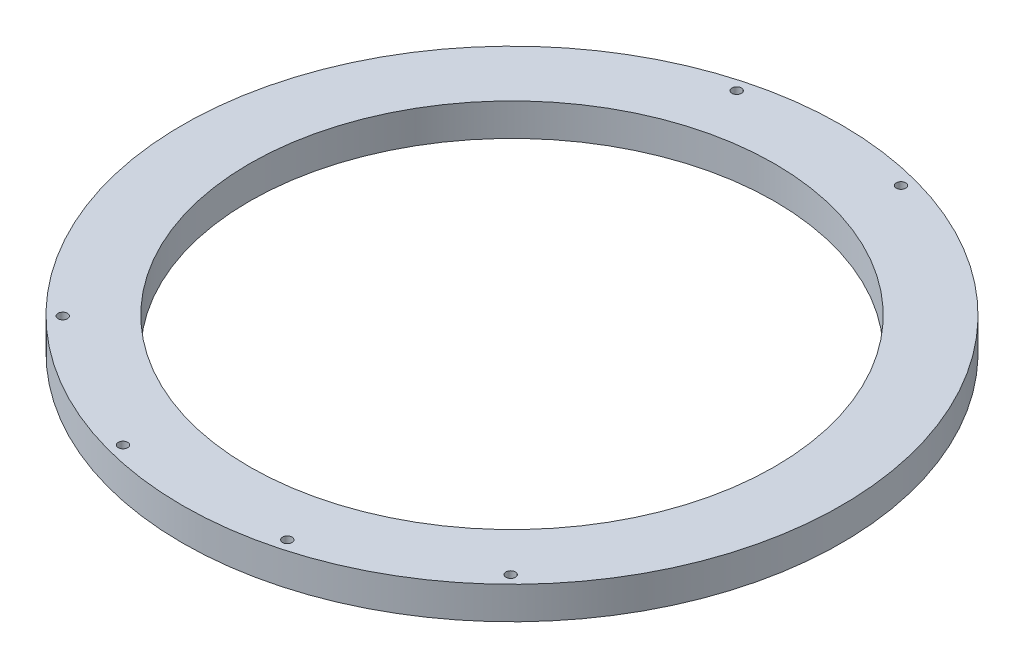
ISO-10303-21;
HEADER;
FILE_DESCRIPTION(('STEP AP214'),'2;1');
FILE_NAME('part.step','',(''),(''),'','','');
FILE_SCHEMA(('AUTOMOTIVE_DESIGN { 1 0 10303 214 1 1 1 1 }'));
ENDSEC;
DATA;
#1=APPLICATION_CONTEXT('core data for automotive mechanical design processes');
#2=APPLICATION_PROTOCOL_DEFINITION('international standard','automotive_design',2000,#1);
#3=PRODUCT_CONTEXT('',#1,'mechanical');
#4=PRODUCT('Part','Part','',(#3));
#5=PRODUCT_RELATED_PRODUCT_CATEGORY('part','',(#4));
#6=PRODUCT_DEFINITION_FORMATION('','',#4);
#7=PRODUCT_DEFINITION_CONTEXT('part definition',#1,'design');
#8=PRODUCT_DEFINITION('design','',#6,#7);
#9=PRODUCT_DEFINITION_SHAPE('','',#8);
#10=(LENGTH_UNIT() NAMED_UNIT(*) SI_UNIT(.MILLI.,.METRE.));
#11=(NAMED_UNIT(*) PLANE_ANGLE_UNIT() SI_UNIT($,.RADIAN.));
#12=(NAMED_UNIT(*) SI_UNIT($,.STERADIAN.) SOLID_ANGLE_UNIT());
#13=UNCERTAINTY_MEASURE_WITH_UNIT(LENGTH_MEASURE(1.E-05),#10,'distance_accuracy_value','');
#14=(GEOMETRIC_REPRESENTATION_CONTEXT(3) GLOBAL_UNCERTAINTY_ASSIGNED_CONTEXT((#13)) GLOBAL_UNIT_ASSIGNED_CONTEXT((#10,
#11,#12)) REPRESENTATION_CONTEXT('',''));
#15=CARTESIAN_POINT('',(0.,0.,0.));
#16=DIRECTION('',(0.,0.,1.));
#17=DIRECTION('',(1.,0.,0.));
#18=AXIS2_PLACEMENT_3D('',#15,#16,#17);
#19=CARTESIAN_POINT('',(0.,3.2258,0.));
#20=DIRECTION('',(0.,1.,0.));
#21=DIRECTION('',(0.,0.,1.));
#22=AXIS2_PLACEMENT_3D('',#19,#20,#21);
#23=PLANE('',#22);
#24=CARTESIAN_POINT('',(22.23135,3.2258,22.3644034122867));
#25=DIRECTION('',(0.,1.,0.));
#26=DIRECTION('',(0.,0.,1.));
#27=AXIS2_PLACEMENT_3D('',#24,#25,#26);
#28=CIRCLE('',#27,0.469899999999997);
#29=CARTESIAN_POINT('',(22.23135,3.2258,22.8343034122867));
#30=VERTEX_POINT('',#29);
#31=EDGE_CURVE('E68',#30,#30,#28,.T.);
#32=ORIENTED_EDGE('',*,*,#31,.F.);
#33=EDGE_LOOP('',(#32));
#34=FACE_BOUND('',#33,.T.);
#35=CARTESIAN_POINT('',(8.1534,3.2258,30.4618044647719));
#36=DIRECTION('',(0.,1.,0.));
#37=DIRECTION('',(0.,0.,1.));
#38=AXIS2_PLACEMENT_3D('',#35,#36,#37);
#39=CIRCLE('',#38,0.469899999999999);
#40=CARTESIAN_POINT('',(8.1534,3.2258,30.9317044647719));
#41=VERTEX_POINT('',#40);
#42=EDGE_CURVE('E74',#41,#41,#39,.T.);
#43=ORIENTED_EDGE('',*,*,#42,.F.);
#44=EDGE_LOOP('',(#43));
#45=FACE_BOUND('',#44,.T.);
#46=CARTESIAN_POINT('',(-8.1534,3.2258,30.4618044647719));
#47=DIRECTION('',(0.,1.,0.));
#48=DIRECTION('',(0.,0.,1.));
#49=AXIS2_PLACEMENT_3D('',#46,#47,#48);
#50=CIRCLE('',#49,0.469899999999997);
#51=CARTESIAN_POINT('',(-8.1534,3.2258,30.9317044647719));
#52=VERTEX_POINT('',#51);
#53=EDGE_CURVE('E80',#52,#52,#50,.T.);
#54=ORIENTED_EDGE('',*,*,#53,.F.);
#55=EDGE_LOOP('',(#54));
#56=FACE_BOUND('',#55,.T.);
#57=CARTESIAN_POINT('',(-22.23135,3.2258,22.3644034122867));
#58=DIRECTION('',(0.,1.,0.));
#59=DIRECTION('',(0.,0.,1.));
#60=AXIS2_PLACEMENT_3D('',#57,#58,#59);
#61=CIRCLE('',#60,0.469899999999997);
#62=CARTESIAN_POINT('',(-22.23135,3.2258,22.8343034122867));
#63=VERTEX_POINT('',#62);
#64=EDGE_CURVE('E56',#63,#63,#61,.T.);
#65=ORIENTED_EDGE('',*,*,#64,.F.);
#66=EDGE_LOOP('',(#65));
#67=FACE_BOUND('',#66,.T.);
#68=CARTESIAN_POINT('',(8.1534,3.2258,-30.4618044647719));
#69=DIRECTION('',(0.,1.,0.));
#70=DIRECTION('',(0.,0.,1.));
#71=AXIS2_PLACEMENT_3D('',#68,#69,#70);
#72=CIRCLE('',#71,0.469900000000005);
#73=CARTESIAN_POINT('',(8.1534,3.2258,-29.9919044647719));
#74=VERTEX_POINT('',#73);
#75=EDGE_CURVE('E63',#74,#74,#72,.T.);
#76=ORIENTED_EDGE('',*,*,#75,.F.);
#77=EDGE_LOOP('',(#76));
#78=FACE_BOUND('',#77,.T.);
#79=CARTESIAN_POINT('',(-8.1534,3.2258,-30.4618044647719));
#80=DIRECTION('',(0.,1.,0.));
#81=DIRECTION('',(0.,0.,1.));
#82=AXIS2_PLACEMENT_3D('',#79,#80,#81);
#83=CIRCLE('',#82,0.469900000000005);
#84=CARTESIAN_POINT('',(-8.1534,3.2258,-29.9919044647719));
#85=VERTEX_POINT('',#84);
#86=EDGE_CURVE('E50',#85,#85,#83,.T.);
#87=ORIENTED_EDGE('',*,*,#86,.F.);
#88=EDGE_LOOP('',(#87));
#89=FACE_BOUND('',#88,.T.);
#90=CARTESIAN_POINT('',(0.,3.2258,0.));
#91=DIRECTION('',(0.,1.,0.));
#92=DIRECTION('',(0.,0.,1.));
#93=AXIS2_PLACEMENT_3D('',#90,#91,#92);
#94=CIRCLE('',#93,32.7152);
#95=CARTESIAN_POINT('',(0.,3.2258,32.7152));
#96=VERTEX_POINT('',#95);
#97=EDGE_CURVE('E10',#96,#96,#94,.T.);
#98=ORIENTED_EDGE('',*,*,#97,.T.);
#99=EDGE_LOOP('',(#98));
#100=FACE_BOUND('',#99,.T.);
#101=CARTESIAN_POINT('',(0.,3.2258,0.));
#102=DIRECTION('',(0.,1.,0.));
#103=DIRECTION('',(0.,0.,1.));
#104=AXIS2_PLACEMENT_3D('',#101,#102,#103);
#105=CIRCLE('',#104,26.0604);
#106=CARTESIAN_POINT('',(0.,3.2258,26.0604));
#107=VERTEX_POINT('',#106);
#108=EDGE_CURVE('E42',#107,#107,#105,.T.);
#109=ORIENTED_EDGE('',*,*,#108,.F.);
#110=EDGE_LOOP('',(#109));
#111=FACE_BOUND('',#110,.T.);
#112=ADVANCED_FACE('F31',(#34,#45,#56,#67,#78,#89,#100,#111),#23,.T.);
#113=CARTESIAN_POINT('',(0.,0.,0.));
#114=DIRECTION('',(0.,1.,0.));
#115=DIRECTION('',(0.,0.,1.));
#116=AXIS2_PLACEMENT_3D('',#113,#114,#115);
#117=PLANE('',#116);
#118=CARTESIAN_POINT('',(22.23135,0.,22.3644034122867));
#119=DIRECTION('',(0.,1.,0.));
#120=DIRECTION('',(0.,0.,1.));
#121=AXIS2_PLACEMENT_3D('',#118,#119,#120);
#122=CIRCLE('',#121,0.469899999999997);
#123=CARTESIAN_POINT('',(22.23135,0.,22.8343034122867));
#124=VERTEX_POINT('',#123);
#125=EDGE_CURVE('E71',#124,#124,#122,.T.);
#126=ORIENTED_EDGE('',*,*,#125,.T.);
#127=EDGE_LOOP('',(#126));
#128=FACE_BOUND('',#127,.T.);
#129=CARTESIAN_POINT('',(8.1534,0.,30.4618044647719));
#130=DIRECTION('',(0.,1.,0.));
#131=DIRECTION('',(0.,0.,1.));
#132=AXIS2_PLACEMENT_3D('',#129,#130,#131);
#133=CIRCLE('',#132,0.469899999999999);
#134=CARTESIAN_POINT('',(8.1534,0.,30.9317044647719));
#135=VERTEX_POINT('',#134);
#136=EDGE_CURVE('E77',#135,#135,#133,.T.);
#137=ORIENTED_EDGE('',*,*,#136,.T.);
#138=EDGE_LOOP('',(#137));
#139=FACE_BOUND('',#138,.T.);
#140=CARTESIAN_POINT('',(-8.1534,0.,30.4618044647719));
#141=DIRECTION('',(0.,1.,0.));
#142=DIRECTION('',(0.,0.,1.));
#143=AXIS2_PLACEMENT_3D('',#140,#141,#142);
#144=CIRCLE('',#143,0.469899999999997);
#145=CARTESIAN_POINT('',(-8.1534,0.,30.9317044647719));
#146=VERTEX_POINT('',#145);
#147=EDGE_CURVE('E60',#146,#146,#144,.T.);
#148=ORIENTED_EDGE('',*,*,#147,.T.);
#149=EDGE_LOOP('',(#148));
#150=FACE_BOUND('',#149,.T.);
#151=CARTESIAN_POINT('',(-22.23135,0.,22.3644034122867));
#152=DIRECTION('',(0.,1.,0.));
#153=DIRECTION('',(0.,0.,1.));
#154=AXIS2_PLACEMENT_3D('',#151,#152,#153);
#155=CIRCLE('',#154,0.469899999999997);
#156=CARTESIAN_POINT('',(-22.23135,0.,22.8343034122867));
#157=VERTEX_POINT('',#156);
#158=EDGE_CURVE('E59',#157,#157,#155,.T.);
#159=ORIENTED_EDGE('',*,*,#158,.T.);
#160=EDGE_LOOP('',(#159));
#161=FACE_BOUND('',#160,.T.);
#162=CARTESIAN_POINT('',(8.1534,0.,-30.4618044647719));
#163=DIRECTION('',(0.,1.,0.));
#164=DIRECTION('',(0.,0.,1.));
#165=AXIS2_PLACEMENT_3D('',#162,#163,#164);
#166=CIRCLE('',#165,0.469900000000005);
#167=CARTESIAN_POINT('',(8.1534,0.,-29.9919044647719));
#168=VERTEX_POINT('',#167);
#169=EDGE_CURVE('E53',#168,#168,#166,.T.);
#170=ORIENTED_EDGE('',*,*,#169,.T.);
#171=EDGE_LOOP('',(#170));
#172=FACE_BOUND('',#171,.T.);
#173=CARTESIAN_POINT('',(-8.1534,0.,-30.4618044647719));
#174=DIRECTION('',(0.,1.,0.));
#175=DIRECTION('',(0.,0.,1.));
#176=AXIS2_PLACEMENT_3D('',#173,#174,#175);
#177=CIRCLE('',#176,0.469900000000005);
#178=CARTESIAN_POINT('',(-8.1534,0.,-29.9919044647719));
#179=VERTEX_POINT('',#178);
#180=EDGE_CURVE('E47',#179,#179,#177,.T.);
#181=ORIENTED_EDGE('',*,*,#180,.T.);
#182=EDGE_LOOP('',(#181));
#183=FACE_BOUND('',#182,.T.);
#184=CARTESIAN_POINT('',(0.,0.,0.));
#185=DIRECTION('',(0.,1.,0.));
#186=DIRECTION('',(0.,0.,1.));
#187=AXIS2_PLACEMENT_3D('',#184,#185,#186);
#188=CIRCLE('',#187,32.7152);
#189=CARTESIAN_POINT('',(0.,0.,32.7152));
#190=VERTEX_POINT('',#189);
#191=EDGE_CURVE('E35',#190,#190,#188,.T.);
#192=ORIENTED_EDGE('',*,*,#191,.F.);
#193=EDGE_LOOP('',(#192));
#194=FACE_BOUND('',#193,.T.);
#195=CARTESIAN_POINT('',(0.,0.,0.));
#196=DIRECTION('',(0.,1.,0.));
#197=DIRECTION('',(0.,0.,1.));
#198=AXIS2_PLACEMENT_3D('',#195,#196,#197);
#199=CIRCLE('',#198,26.0604);
#200=CARTESIAN_POINT('',(0.,0.,26.0604));
#201=VERTEX_POINT('',#200);
#202=EDGE_CURVE('E44',#201,#201,#199,.T.);
#203=ORIENTED_EDGE('',*,*,#202,.T.);
#204=EDGE_LOOP('',(#203));
#205=FACE_BOUND('',#204,.T.);
#206=ADVANCED_FACE('F86',(#128,#139,#150,#161,#172,#183,#194,#205),#117,.F.);
#207=CARTESIAN_POINT('',(0.,3.2258,0.));
#208=DIRECTION('',(0.,-1.,0.));
#209=DIRECTION('',(0.,0.,-1.));
#210=AXIS2_PLACEMENT_3D('',#207,#208,#209);
#211=CYLINDRICAL_SURFACE('',#210,32.7152);
#212=ORIENTED_EDGE('',*,*,#97,.F.);
#213=EDGE_LOOP('',(#212));
#214=FACE_BOUND('',#213,.T.);
#215=ORIENTED_EDGE('',*,*,#191,.T.);
#216=EDGE_LOOP('',(#215));
#217=FACE_BOUND('',#216,.T.);
#218=ADVANCED_FACE('F33',(#214,#217),#211,.T.);
#219=CARTESIAN_POINT('',(0.,3.2258,0.));
#220=DIRECTION('',(0.,-1.,0.));
#221=DIRECTION('',(0.,0.,-1.));
#222=AXIS2_PLACEMENT_3D('',#219,#220,#221);
#223=CYLINDRICAL_SURFACE('',#222,26.0604);
#224=ORIENTED_EDGE('',*,*,#108,.T.);
#225=EDGE_LOOP('',(#224));
#226=FACE_BOUND('',#225,.T.);
#227=ORIENTED_EDGE('',*,*,#202,.F.);
#228=EDGE_LOOP('',(#227));
#229=FACE_BOUND('',#228,.T.);
#230=ADVANCED_FACE('F109',(#226,#229),#223,.F.);
#231=CARTESIAN_POINT('',(-8.1534,0.,-30.4618044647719));
#232=DIRECTION('',(0.,1.,0.));
#233=DIRECTION('',(0.,0.,1.));
#234=AXIS2_PLACEMENT_3D('',#231,#232,#233);
#235=CYLINDRICAL_SURFACE('',#234,0.469900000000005);
#236=ORIENTED_EDGE('',*,*,#180,.F.);
#237=EDGE_LOOP('',(#236));
#238=FACE_BOUND('',#237,.T.);
#239=ORIENTED_EDGE('',*,*,#86,.T.);
#240=EDGE_LOOP('',(#239));
#241=FACE_BOUND('',#240,.T.);
#242=ADVANCED_FACE('F112',(#238,#241),#235,.F.);
#243=CARTESIAN_POINT('',(8.1534,0.,-30.4618044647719));
#244=DIRECTION('',(0.,1.,0.));
#245=DIRECTION('',(0.,0.,1.));
#246=AXIS2_PLACEMENT_3D('',#243,#244,#245);
#247=CYLINDRICAL_SURFACE('',#246,0.469900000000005);
#248=ORIENTED_EDGE('',*,*,#169,.F.);
#249=EDGE_LOOP('',(#248));
#250=FACE_BOUND('',#249,.T.);
#251=ORIENTED_EDGE('',*,*,#75,.T.);
#252=EDGE_LOOP('',(#251));
#253=FACE_BOUND('',#252,.T.);
#254=ADVANCED_FACE('F127',(#250,#253),#247,.F.);
#255=CARTESIAN_POINT('',(-22.23135,0.,22.3644034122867));
#256=DIRECTION('',(0.,1.,0.));
#257=DIRECTION('',(0.,0.,1.));
#258=AXIS2_PLACEMENT_3D('',#255,#256,#257);
#259=CYLINDRICAL_SURFACE('',#258,0.469899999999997);
#260=ORIENTED_EDGE('',*,*,#158,.F.);
#261=EDGE_LOOP('',(#260));
#262=FACE_BOUND('',#261,.T.);
#263=ORIENTED_EDGE('',*,*,#64,.T.);
#264=EDGE_LOOP('',(#263));
#265=FACE_BOUND('',#264,.T.);
#266=ADVANCED_FACE('F93',(#262,#265),#259,.F.);
#267=CARTESIAN_POINT('',(-8.1534,0.,30.4618044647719));
#268=DIRECTION('',(0.,1.,0.));
#269=DIRECTION('',(0.,0.,1.));
#270=AXIS2_PLACEMENT_3D('',#267,#268,#269);
#271=CYLINDRICAL_SURFACE('',#270,0.469899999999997);
#272=ORIENTED_EDGE('',*,*,#147,.F.);
#273=EDGE_LOOP('',(#272));
#274=FACE_BOUND('',#273,.T.);
#275=ORIENTED_EDGE('',*,*,#53,.T.);
#276=EDGE_LOOP('',(#275));
#277=FACE_BOUND('',#276,.T.);
#278=ADVANCED_FACE('F89',(#274,#277),#271,.F.);
#279=CARTESIAN_POINT('',(8.1534,0.,30.4618044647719));
#280=DIRECTION('',(0.,1.,0.));
#281=DIRECTION('',(0.,0.,1.));
#282=AXIS2_PLACEMENT_3D('',#279,#280,#281);
#283=CYLINDRICAL_SURFACE('',#282,0.469899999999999);
#284=ORIENTED_EDGE('',*,*,#136,.F.);
#285=EDGE_LOOP('',(#284));
#286=FACE_BOUND('',#285,.T.);
#287=ORIENTED_EDGE('',*,*,#42,.T.);
#288=EDGE_LOOP('',(#287));
#289=FACE_BOUND('',#288,.T.);
#290=ADVANCED_FACE('F92',(#286,#289),#283,.F.);
#291=CARTESIAN_POINT('',(22.23135,0.,22.3644034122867));
#292=DIRECTION('',(0.,1.,0.));
#293=DIRECTION('',(0.,0.,1.));
#294=AXIS2_PLACEMENT_3D('',#291,#292,#293);
#295=CYLINDRICAL_SURFACE('',#294,0.469899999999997);
#296=ORIENTED_EDGE('',*,*,#125,.F.);
#297=EDGE_LOOP('',(#296));
#298=FACE_BOUND('',#297,.T.);
#299=ORIENTED_EDGE('',*,*,#31,.T.);
#300=EDGE_LOOP('',(#299));
#301=FACE_BOUND('',#300,.T.);
#302=ADVANCED_FACE('F135',(#298,#301),#295,.F.);
#303=CLOSED_SHELL('',(#112,#206,#218,#230,#242,#254,#266,#278,#290,#302));
#304=MANIFOLD_SOLID_BREP('B2',#303);
#305=ADVANCED_BREP_SHAPE_REPRESENTATION('',(#18,#304),#14);
#306=SHAPE_DEFINITION_REPRESENTATION(#9,#305);
ENDSEC;
END-ISO-10303-21;
